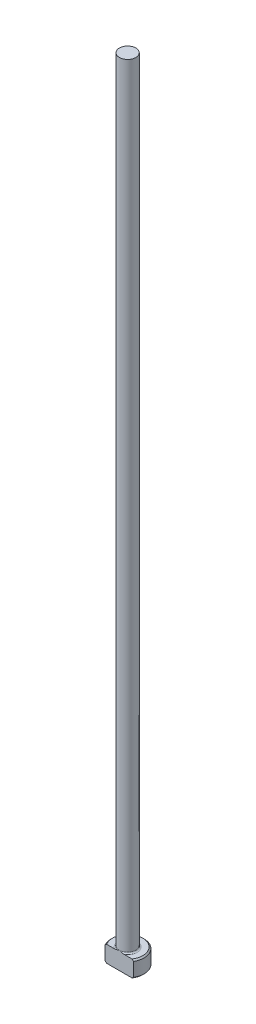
ISO-10303-21;
HEADER;
FILE_DESCRIPTION(('STEP AP214'),'2;1');
FILE_NAME('part.step','',(''),(''),'','','');
FILE_SCHEMA(('AUTOMOTIVE_DESIGN { 1 0 10303 214 1 1 1 1 }'));
ENDSEC;
DATA;
#1=APPLICATION_CONTEXT('core data for automotive mechanical design processes');
#2=APPLICATION_PROTOCOL_DEFINITION('international standard','automotive_design',2000,#1);
#3=PRODUCT_CONTEXT('',#1,'mechanical');
#4=PRODUCT('Part','Part','',(#3));
#5=PRODUCT_RELATED_PRODUCT_CATEGORY('part','',(#4));
#6=PRODUCT_DEFINITION_FORMATION('','',#4);
#7=PRODUCT_DEFINITION_CONTEXT('part definition',#1,'design');
#8=PRODUCT_DEFINITION('design','',#6,#7);
#9=PRODUCT_DEFINITION_SHAPE('','',#8);
#10=(LENGTH_UNIT() NAMED_UNIT(*) SI_UNIT(.MILLI.,.METRE.));
#11=(NAMED_UNIT(*) PLANE_ANGLE_UNIT() SI_UNIT($,.RADIAN.));
#12=(NAMED_UNIT(*) SI_UNIT($,.STERADIAN.) SOLID_ANGLE_UNIT());
#13=UNCERTAINTY_MEASURE_WITH_UNIT(LENGTH_MEASURE(1.E-05),#10,'distance_accuracy_value','');
#14=(GEOMETRIC_REPRESENTATION_CONTEXT(3) GLOBAL_UNCERTAINTY_ASSIGNED_CONTEXT((#13)) GLOBAL_UNIT_ASSIGNED_CONTEXT((#10,
#11,#12)) REPRESENTATION_CONTEXT('',''));
#15=CARTESIAN_POINT('',(0.,0.,0.));
#16=DIRECTION('',(0.,0.,1.));
#17=DIRECTION('',(1.,0.,0.));
#18=AXIS2_PLACEMENT_3D('',#15,#16,#17);
#19=CARTESIAN_POINT('',(0.,0.,0.));
#20=DIRECTION('',(0.,-1.,0.));
#21=DIRECTION('',(0.,0.,-1.));
#22=AXIS2_PLACEMENT_3D('',#19,#20,#21);
#23=PLANE('',#22);
#24=CARTESIAN_POINT('',(0.,0.,0.));
#25=DIRECTION('',(0.,-1.,0.));
#26=DIRECTION('',(0.,0.,-1.));
#27=AXIS2_PLACEMENT_3D('',#24,#25,#26);
#28=CIRCLE('',#27,2.92099999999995);
#29=CARTESIAN_POINT('',(-2.45195529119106,0.,1.58749999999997));
#30=VERTEX_POINT('',#29);
#31=CARTESIAN_POINT('',(2.45195529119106,0.,1.58749999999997));
#32=VERTEX_POINT('',#31);
#33=EDGE_CURVE('E98',#30,#32,#28,.T.);
#34=ORIENTED_EDGE('',*,*,#33,.T.);
#35=DIRECTION('',(-1.,0.,0.));
#36=VECTOR('',#35,1.);
#37=CARTESIAN_POINT('',(-2.74963065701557,0.,1.58749999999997));
#38=LINE('',#37,#36);
#39=EDGE_CURVE('E83',#32,#30,#38,.T.);
#40=ORIENTED_EDGE('',*,*,#39,.T.);
#41=EDGE_LOOP('',(#34,#40));
#42=FACE_BOUND('',#41,.T.);
#43=ADVANCED_FACE('F32',(#42),#23,.T.);
#44=CARTESIAN_POINT('',(0.,259.958771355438,0.));
#45=DIRECTION('',(0.,1.,0.));
#46=DIRECTION('',(0.,0.,1.));
#47=AXIS2_PLACEMENT_3D('',#44,#45,#46);
#48=CYLINDRICAL_SURFACE('',#47,3.17499999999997);
#49=CARTESIAN_POINT('',(0.,2.92099999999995,0.));
#50=DIRECTION('',(0.,1.,0.));
#51=DIRECTION('',(0.,0.,1.));
#52=AXIS2_PLACEMENT_3D('',#49,#50,#51);
#53=CIRCLE('',#52,3.17499999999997);
#54=CARTESIAN_POINT('',(-2.74963065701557,2.92099999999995,1.58749999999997));
#55=VERTEX_POINT('',#54);
#56=CARTESIAN_POINT('',(2.74963065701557,2.92099999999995,1.58749999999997));
#57=VERTEX_POINT('',#56);
#58=EDGE_CURVE('E104',#55,#57,#53,.F.);
#59=ORIENTED_EDGE('',*,*,#58,.T.);
#60=DIRECTION('',(0.,-1.,0.));
#61=VECTOR('',#60,1.);
#62=CARTESIAN_POINT('',(2.74963065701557,152.4,1.58749999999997));
#63=LINE('',#62,#61);
#64=CARTESIAN_POINT('',(2.74963065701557,0.254000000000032,1.58749999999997));
#65=VERTEX_POINT('',#64);
#66=EDGE_CURVE('E183',#57,#65,#63,.T.);
#67=ORIENTED_EDGE('',*,*,#66,.T.);
#68=CARTESIAN_POINT('',(0.,0.254000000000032,0.));
#69=DIRECTION('',(0.,-1.,0.));
#70=DIRECTION('',(0.,0.,-1.));
#71=AXIS2_PLACEMENT_3D('',#68,#69,#70);
#72=CIRCLE('',#71,3.17499999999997);
#73=CARTESIAN_POINT('',(-2.74963065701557,0.254000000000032,1.58749999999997));
#74=VERTEX_POINT('',#73);
#75=EDGE_CURVE('E100',#65,#74,#72,.F.);
#76=ORIENTED_EDGE('',*,*,#75,.T.);
#77=DIRECTION('',(0.,-1.,0.));
#78=VECTOR('',#77,1.);
#79=CARTESIAN_POINT('',(-2.74963065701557,152.4,1.58749999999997));
#80=LINE('',#79,#78);
#81=EDGE_CURVE('E93',#55,#74,#80,.T.);
#82=ORIENTED_EDGE('',*,*,#81,.F.);
#83=EDGE_LOOP('',(#59,#67,#76,#82));
#84=FACE_BOUND('',#83,.T.);
#85=ADVANCED_FACE('F158',(#84),#48,.T.);
#86=CARTESIAN_POINT('',(-3.17499999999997,3.175,0.));
#87=DIRECTION('',(0.,1.,0.));
#88=DIRECTION('',(0.,0.,1.));
#89=AXIS2_PLACEMENT_3D('',#86,#87,#88);
#90=PLANE('',#89);
#91=CARTESIAN_POINT('',(0.,3.175,0.));
#92=DIRECTION('',(0.,1.,0.));
#93=DIRECTION('',(0.,0.,1.));
#94=AXIS2_PLACEMENT_3D('',#91,#92,#93);
#95=CIRCLE('',#94,2.92099999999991);
#96=CARTESIAN_POINT('',(2.451955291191,3.175,1.58749999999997));
#97=VERTEX_POINT('',#96);
#98=CARTESIAN_POINT('',(-2.451955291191,3.175,1.58749999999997));
#99=VERTEX_POINT('',#98);
#100=EDGE_CURVE('E178',#97,#99,#95,.T.);
#101=ORIENTED_EDGE('',*,*,#100,.T.);
#102=DIRECTION('',(1.,0.,0.));
#103=VECTOR('',#102,1.);
#104=CARTESIAN_POINT('',(-3.17499999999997,3.175,1.58749999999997));
#105=LINE('',#104,#103);
#106=CARTESIAN_POINT('',(-0.933255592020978,3.17500000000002,1.58749999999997));
#107=VERTEX_POINT('',#106);
#108=EDGE_CURVE('E57',#99,#107,#105,.T.);
#109=ORIENTED_EDGE('',*,*,#108,.T.);
#110=CARTESIAN_POINT('',(0.,3.175,0.));
#111=DIRECTION('',(0.,1.,0.));
#112=DIRECTION('',(0.,0.,1.));
#113=AXIS2_PLACEMENT_3D('',#110,#111,#112);
#114=CIRCLE('',#113,1.84149999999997);
#115=CARTESIAN_POINT('',(0.933255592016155,3.17500000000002,1.58749999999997));
#116=VERTEX_POINT('',#115);
#117=EDGE_CURVE('E107',#107,#116,#114,.F.);
#118=ORIENTED_EDGE('',*,*,#117,.T.);
#119=EDGE_CURVE('E136',#116,#97,#105,.T.);
#120=ORIENTED_EDGE('',*,*,#119,.T.);
#121=EDGE_LOOP('',(#101,#109,#118,#120));
#122=FACE_BOUND('',#121,.T.);
#123=ADVANCED_FACE('F147',(#122),#90,.T.);
#124=CARTESIAN_POINT('',(0.,3.17499999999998,0.));
#125=DIRECTION('',(0.,-1.,0.));
#126=DIRECTION('',(0.,0.,-1.));
#127=AXIS2_PLACEMENT_3D('',#124,#125,#126);
#128=CONICAL_SURFACE('',#127,2.92099999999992,0.785398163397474);
#129=ORIENTED_EDGE('',*,*,#58,.F.);
#130=CARTESIAN_POINT('',(-6.0529050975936,-0.161620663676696,1.58749999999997));
#131=CARTESIAN_POINT('',(-5.91567682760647,-0.0288893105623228,1.58749999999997));
#132=CARTESIAN_POINT('',(-5.77831035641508,0.103699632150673,1.58749999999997));
#133=CARTESIAN_POINT('',(-5.50321874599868,0.368508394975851,1.58749999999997));
#134=CARTESIAN_POINT('',(-5.36549360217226,0.500728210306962,1.58749999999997));
#135=CARTESIAN_POINT('',(-5.08953516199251,0.764778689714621,1.58749999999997));
#136=CARTESIAN_POINT('',(-4.95130164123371,0.896609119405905,1.58749999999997));
#137=CARTESIAN_POINT('',(-4.67428233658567,1.15968706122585,1.58749999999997));
#138=CARTESIAN_POINT('',(-4.53549655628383,1.29093457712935,1.58749999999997));
#139=CARTESIAN_POINT('',(-4.25997724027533,1.55007705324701,1.58749999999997));
#140=CARTESIAN_POINT('',(-4.12325766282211,1.67798684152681,1.58749999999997));
#141=CARTESIAN_POINT('',(-3.8489289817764,1.9328486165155,1.58749999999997));
#142=CARTESIAN_POINT('',(-3.71131988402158,2.0598006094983,1.58749999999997));
#143=CARTESIAN_POINT('',(-3.43493978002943,2.31237508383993,1.58749999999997));
#144=CARTESIAN_POINT('',(-3.29616903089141,2.43799784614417,1.58749999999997));
#145=CARTESIAN_POINT('',(-3.01699558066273,2.68741369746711,1.58749999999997));
#146=CARTESIAN_POINT('',(-2.87659294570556,2.81120686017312,1.58749999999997));
#147=CARTESIAN_POINT('',(-2.64816703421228,3.00875865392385,1.58749999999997));
#148=CARTESIAN_POINT('',(-2.56087478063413,3.0833615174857,1.58749999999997));
#149=CARTESIAN_POINT('',(-2.38515423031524,3.23123871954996,1.58749999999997));
#150=CARTESIAN_POINT('',(-2.29672582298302,3.30451292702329,1.58749999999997));
#151=CARTESIAN_POINT('',(-2.117474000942,3.45004422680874,1.58749999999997));
#152=CARTESIAN_POINT('',(-2.02663514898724,3.52228237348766,1.58749999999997));
#153=CARTESIAN_POINT('',(-1.84302524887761,3.66423097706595,1.58749999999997));
#154=CARTESIAN_POINT('',(-1.75025467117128,3.73394203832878,1.58749999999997));
#155=CARTESIAN_POINT('',(-1.56067475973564,3.87080633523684,1.58749999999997));
#156=CARTESIAN_POINT('',(-1.46382547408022,3.93790459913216,1.58749999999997));
#157=CARTESIAN_POINT('',(-1.26632594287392,4.06669147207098,1.58749999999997));
#158=CARTESIAN_POINT('',(-1.16567073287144,4.12837264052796,1.58749999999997));
#159=CARTESIAN_POINT('',(-1.01165766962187,4.21402252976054,1.58749999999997));
#160=CARTESIAN_POINT('',(-0.960142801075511,4.24127929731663,1.58749999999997));
#161=CARTESIAN_POINT('',(-0.855780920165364,4.29309798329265,1.58749999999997));
#162=CARTESIAN_POINT('',(-0.802933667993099,4.31765941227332,1.58749999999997));
#163=CARTESIAN_POINT('',(-0.642461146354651,4.38614656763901,1.58749999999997));
#164=CARTESIAN_POINT('',(-0.532518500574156,4.42510149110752,1.58749999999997));
#165=CARTESIAN_POINT('',(-0.367680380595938,4.46726244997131,1.58749999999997));
#166=CARTESIAN_POINT('',(-0.314802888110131,4.47844427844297,1.58749999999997));
#167=CARTESIAN_POINT('',(-0.20820970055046,4.49576654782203,1.58749999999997));
#168=CARTESIAN_POINT('',(-0.15449408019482,4.50190743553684,1.58749999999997));
#169=CARTESIAN_POINT('',(-0.0468792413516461,4.50871296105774,1.58749999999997));
#170=CARTESIAN_POINT('',(0.00701889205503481,4.50939451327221,1.58749999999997));
#171=CARTESIAN_POINT('',(0.11460608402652,4.50527679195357,1.58749999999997));
#172=CARTESIAN_POINT('',(0.168295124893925,4.50047706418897,1.58749999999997));
#173=CARTESIAN_POINT('',(0.274485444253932,4.48579689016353,1.58749999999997));
#174=CARTESIAN_POINT('',(0.326992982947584,4.47596081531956,1.58749999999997));
#175=CARTESIAN_POINT('',(0.430974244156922,4.45181809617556,1.58749999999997));
#176=CARTESIAN_POINT('',(0.482447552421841,4.43750969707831,1.58749999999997));
#177=CARTESIAN_POINT('',(0.58446088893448,4.4050248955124,1.58749999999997));
#178=CARTESIAN_POINT('',(0.6349940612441,4.38682724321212,1.58749999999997));
#179=CARTESIAN_POINT('',(0.734789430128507,4.34729308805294,1.58749999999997));
#180=CARTESIAN_POINT('',(0.784051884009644,4.32595722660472,1.58749999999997));
#181=CARTESIAN_POINT('',(0.930549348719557,4.25791922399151,1.58749999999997));
#182=CARTESIAN_POINT('',(1.02598802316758,4.20736047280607,1.58749999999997));
#183=CARTESIAN_POINT('',(1.21304313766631,4.09955451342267,1.58749999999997));
#184=CARTESIAN_POINT('',(1.3046547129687,4.04229912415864,1.58749999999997));
#185=CARTESIAN_POINT('',(1.48526211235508,3.92308746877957,1.58749999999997));
#186=CARTESIAN_POINT('',(1.57424615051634,3.86111349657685,1.58749999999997));
#187=CARTESIAN_POINT('',(1.74990003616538,3.73408621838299,1.58749999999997));
#188=CARTESIAN_POINT('',(1.83657099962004,3.66903444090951,1.58749999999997));
#189=CARTESIAN_POINT('',(2.0093176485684,3.5358337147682,1.58749999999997));
#190=CARTESIAN_POINT('',(2.09537048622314,3.46765527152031,1.58749999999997));
#191=CARTESIAN_POINT('',(2.26611736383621,3.32960643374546,1.58749999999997));
#192=CARTESIAN_POINT('',(2.35081125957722,3.25973586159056,1.58749999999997));
#193=CARTESIAN_POINT('',(2.6029012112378,3.04858139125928,1.58749999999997));
#194=CARTESIAN_POINT('',(2.76872537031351,2.90542388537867,1.58749999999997));
#195=CARTESIAN_POINT('',(3.0697091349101,2.64069522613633,1.58749999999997));
#196=CARTESIAN_POINT('',(3.20528660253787,2.51959458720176,1.58749999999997));
#197=CARTESIAN_POINT('',(3.47510321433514,2.27590400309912,1.58749999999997));
#198=CARTESIAN_POINT('',(3.60934232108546,2.15331401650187,1.58749999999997));
#199=CARTESIAN_POINT('',(3.87695374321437,1.90694239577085,1.58749999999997));
#200=CARTESIAN_POINT('',(4.01032512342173,1.78315974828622,1.58749999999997));
#201=CARTESIAN_POINT('',(4.27630880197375,1.53478104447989,1.58749999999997));
#202=CARTESIAN_POINT('',(4.40892109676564,1.41018498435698,1.58749999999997));
#203=CARTESIAN_POINT('',(4.79499418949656,1.04574684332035,1.58749999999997));
#204=CARTESIAN_POINT('',(5.04767313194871,0.805076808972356,1.58749999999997));
#205=CARTESIAN_POINT('',(5.42550911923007,0.443121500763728,1.58749999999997));
#206=CARTESIAN_POINT('',(5.55118772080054,0.322378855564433,1.58749999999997));
#207=CARTESIAN_POINT('',(5.80225207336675,0.0805914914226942,1.58749999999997));
#208=CARTESIAN_POINT('',(5.92763782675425,-0.0404532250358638,1.58749999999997));
#209=CARTESIAN_POINT('',(6.0529050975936,-0.161620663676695,1.58749999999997));
#210=B_SPLINE_CURVE_WITH_KNOTS('',3,(#130,#131,#132,#133,#134,#135,#136,#137,#138,#139,#140,
#141,#142,#143,#144,#145,#146,#147,#148,#149,#150,#151,#152,#153,#154,#155,#156,#157,#158,#159,
#160,#161,#162,#163,#164,#165,#166,#167,#168,#169,#170,#171,#172,#173,#174,#175,#176,#177,#178,
#179,#180,#181,#182,#183,#184,#185,#186,#187,#188,#189,#190,#191,#192,#193,#194,#195,#196,#197,
#198,#199,#200,#201,#202,#203,#204,#205,#206,#207,#208,#209),.UNSPECIFIED.,.F.,.F.,(4,2,2,2,2,2,
2,2,2,2,2,2,2,2,2,2,2,2,2,2,2,2,2,2,2,2,2,2,2,2,2,2,2,2,2,2,2,2,2,4),(0.,0.572750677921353,
1.14550874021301,1.7185605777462,2.29160869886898,2.8532800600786,3.41494773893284,
3.97649423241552,4.53801804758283,4.88249307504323,5.22700189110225,5.57515326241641,
5.92322081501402,6.27657800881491,6.63041319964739,6.80518126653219,6.97998101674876,
7.32824262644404,7.49018491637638,7.65211285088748,7.81353889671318,7.97497832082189,
8.13501929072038,8.29512313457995,8.45612518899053,8.6170943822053,8.94062993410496,
9.26456495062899,9.58978187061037,9.9148389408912,10.2441741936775,10.573544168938,
11.2306812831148,11.7760337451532,12.3214014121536,12.8672825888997,13.4131663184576,
14.4600164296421,14.982859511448,15.5056983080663),.UNSPECIFIED.);
#211=EDGE_CURVE('E135',#55,#99,#210,.T.);
#212=ORIENTED_EDGE('',*,*,#211,.T.);
#213=ORIENTED_EDGE('',*,*,#100,.F.);
#214=EDGE_CURVE('E127',#97,#57,#210,.T.);
#215=ORIENTED_EDGE('',*,*,#214,.T.);
#216=EDGE_LOOP('',(#129,#212,#213,#215));
#217=FACE_BOUND('',#216,.T.);
#218=ADVANCED_FACE('F143',(#217),#128,.T.);
#219=CARTESIAN_POINT('',(0.,0.254000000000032,0.));
#220=DIRECTION('',(0.,1.,0.));
#221=DIRECTION('',(0.,0.,1.));
#222=AXIS2_PLACEMENT_3D('',#219,#220,#221);
#223=CONICAL_SURFACE('',#222,3.17499999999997,0.785398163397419);
#224=ORIENTED_EDGE('',*,*,#75,.F.);
#225=CARTESIAN_POINT('',(6.0529050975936,3.33662066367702,1.58749999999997));
#226=CARTESIAN_POINT('',(5.91567682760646,3.20388931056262,1.58749999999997));
#227=CARTESIAN_POINT('',(5.77831035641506,3.0713003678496,1.58749999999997));
#228=CARTESIAN_POINT('',(5.50321874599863,2.80649160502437,1.58749999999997));
#229=CARTESIAN_POINT('',(5.36549360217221,2.67427178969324,1.58749999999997));
#230=CARTESIAN_POINT('',(5.08953516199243,2.41022131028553,1.58749999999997));
#231=CARTESIAN_POINT('',(4.95130164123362,2.27839088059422,1.58749999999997));
#232=CARTESIAN_POINT('',(4.67428233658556,2.01531293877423,1.58749999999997));
#233=CARTESIAN_POINT('',(4.5354965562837,1.88406542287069,1.58749999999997));
#234=CARTESIAN_POINT('',(4.25997724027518,1.62492294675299,1.58749999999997));
#235=CARTESIAN_POINT('',(4.12325766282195,1.49701315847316,1.58749999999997));
#236=CARTESIAN_POINT('',(3.84892898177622,1.24215138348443,1.58749999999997));
#237=CARTESIAN_POINT('',(3.71131988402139,1.11519939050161,1.58749999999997));
#238=CARTESIAN_POINT('',(3.43493978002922,0.862624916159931,1.58749999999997));
#239=CARTESIAN_POINT('',(3.29616903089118,0.737002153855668,1.58749999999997));
#240=CARTESIAN_POINT('',(3.01699558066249,0.487586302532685,1.58749999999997));
#241=CARTESIAN_POINT('',(2.8765929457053,0.363793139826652,1.58749999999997));
#242=CARTESIAN_POINT('',(2.64816703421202,0.166241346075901,1.58749999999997));
#243=CARTESIAN_POINT('',(2.56087478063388,0.091638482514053,1.58749999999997));
#244=CARTESIAN_POINT('',(2.385154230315,-0.0562387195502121,1.58749999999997));
#245=CARTESIAN_POINT('',(2.29672582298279,-0.129512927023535,1.58749999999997));
#246=CARTESIAN_POINT('',(2.11747400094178,-0.275044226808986,1.58749999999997));
#247=CARTESIAN_POINT('',(2.02663514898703,-0.347282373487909,1.58749999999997));
#248=CARTESIAN_POINT('',(1.84302524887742,-0.489230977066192,1.58749999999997));
#249=CARTESIAN_POINT('',(1.75025467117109,-0.558942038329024,1.58749999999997));
#250=CARTESIAN_POINT('',(1.56067475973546,-0.695806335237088,1.58749999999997));
#251=CARTESIAN_POINT('',(1.46382547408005,-0.762904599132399,1.58749999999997));
#252=CARTESIAN_POINT('',(1.26632594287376,-0.891691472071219,1.58749999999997));
#253=CARTESIAN_POINT('',(1.16567073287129,-0.953372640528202,1.58749999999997));
#254=CARTESIAN_POINT('',(1.01165766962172,-1.03902252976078,1.58749999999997));
#255=CARTESIAN_POINT('',(0.96014280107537,-1.06627929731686,1.58749999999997));
#256=CARTESIAN_POINT('',(0.855780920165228,-1.11809798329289,1.58749999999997));
#257=CARTESIAN_POINT('',(0.802933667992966,-1.14265941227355,1.58749999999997));
#258=CARTESIAN_POINT('',(0.642461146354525,-1.21114656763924,1.58749999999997));
#259=CARTESIAN_POINT('',(0.532518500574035,-1.25010149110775,1.58749999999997));
#260=CARTESIAN_POINT('',(0.367680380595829,-1.29226244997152,1.58749999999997));
#261=CARTESIAN_POINT('',(0.314802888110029,-1.30344427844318,1.58749999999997));
#262=CARTESIAN_POINT('',(0.208209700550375,-1.32076654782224,1.58749999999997));
#263=CARTESIAN_POINT('',(0.154494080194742,-1.32690743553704,1.58749999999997));
#264=CARTESIAN_POINT('',(0.0468792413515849,-1.33371296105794,1.58749999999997));
#265=CARTESIAN_POINT('',(-0.0070188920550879,-1.3343945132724,1.58749999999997));
#266=CARTESIAN_POINT('',(-0.114606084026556,-1.33027679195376,1.58749999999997));
#267=CARTESIAN_POINT('',(-0.168295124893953,-1.32547706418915,1.58749999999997));
#268=CARTESIAN_POINT('',(-0.274485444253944,-1.31079689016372,1.58749999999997));
#269=CARTESIAN_POINT('',(-0.326992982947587,-1.30096081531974,1.58749999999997));
#270=CARTESIAN_POINT('',(-0.430974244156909,-1.27681809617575,1.58749999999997));
#271=CARTESIAN_POINT('',(-0.48244755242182,-1.2625096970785,1.58749999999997));
#272=CARTESIAN_POINT('',(-0.584460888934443,-1.2300248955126,1.58749999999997));
#273=CARTESIAN_POINT('',(-0.634994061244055,-1.21182724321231,1.58749999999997));
#274=CARTESIAN_POINT('',(-0.734789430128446,-1.17229308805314,1.58749999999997));
#275=CARTESIAN_POINT('',(-0.784051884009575,-1.15095722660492,1.58749999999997));
#276=CARTESIAN_POINT('',(-0.930549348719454,-1.08291922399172,1.58749999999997));
#277=CARTESIAN_POINT('',(-1.02598802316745,-1.03236047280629,1.58749999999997));
#278=CARTESIAN_POINT('',(-1.21304313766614,-0.924554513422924,1.58749999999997));
#279=CARTESIAN_POINT('',(-1.3046547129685,-0.867299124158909,1.58749999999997));
#280=CARTESIAN_POINT('',(-1.48526211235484,-0.748087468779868,1.58749999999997));
#281=CARTESIAN_POINT('',(-1.57424615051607,-0.686113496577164,1.58749999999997));
#282=CARTESIAN_POINT('',(-1.74990003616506,-0.559086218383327,1.58749999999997));
#283=CARTESIAN_POINT('',(-1.8365709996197,-0.494034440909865,1.58749999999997));
#284=CARTESIAN_POINT('',(-2.00931764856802,-0.360833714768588,1.58749999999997));
#285=CARTESIAN_POINT('',(-2.09537048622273,-0.29265527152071,1.58749999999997));
#286=CARTESIAN_POINT('',(-2.26611736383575,-0.154606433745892,1.58749999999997));
#287=CARTESIAN_POINT('',(-2.35081125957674,-0.0847358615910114,1.58749999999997));
#288=CARTESIAN_POINT('',(-2.60290121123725,0.126418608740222,1.58749999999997));
#289=CARTESIAN_POINT('',(-2.76872537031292,0.269576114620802,1.58749999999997));
#290=CARTESIAN_POINT('',(-3.06970913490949,0.534304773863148,1.58749999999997));
#291=CARTESIAN_POINT('',(-3.2052866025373,0.655405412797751,1.58749999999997));
#292=CARTESIAN_POINT('',(-3.47510321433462,0.899095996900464,1.58749999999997));
#293=CARTESIAN_POINT('',(-3.60934232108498,1.02168598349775,1.58749999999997));
#294=CARTESIAN_POINT('',(-3.87695374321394,1.26805760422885,1.58749999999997));
#295=CARTESIAN_POINT('',(-4.01032512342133,1.39184025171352,1.58749999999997));
#296=CARTESIAN_POINT('',(-4.27630880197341,1.64021895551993,1.58749999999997));
#297=CARTESIAN_POINT('',(-4.40892109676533,1.76481501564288,1.58749999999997));
#298=CARTESIAN_POINT('',(-4.79499418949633,2.12925315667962,1.58749999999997));
#299=CARTESIAN_POINT('',(-5.04767313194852,2.36992319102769,1.58749999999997));
#300=CARTESIAN_POINT('',(-5.42550911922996,2.73187849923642,1.58749999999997));
#301=CARTESIAN_POINT('',(-5.55118772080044,2.85262114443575,1.58749999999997));
#302=CARTESIAN_POINT('',(-5.80225207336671,3.09440850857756,1.58749999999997));
#303=CARTESIAN_POINT('',(-5.92763782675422,3.21545322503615,1.58749999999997));
#304=CARTESIAN_POINT('',(-6.0529050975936,3.33662066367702,1.58749999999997));
#305=B_SPLINE_CURVE_WITH_KNOTS('',3,(#225,#226,#227,#228,#229,#230,#231,#232,#233,#234,#235,
#236,#237,#238,#239,#240,#241,#242,#243,#244,#245,#246,#247,#248,#249,#250,#251,#252,#253,#254,
#255,#256,#257,#258,#259,#260,#261,#262,#263,#264,#265,#266,#267,#268,#269,#270,#271,#272,#273,
#274,#275,#276,#277,#278,#279,#280,#281,#282,#283,#284,#285,#286,#287,#288,#289,#290,#291,#292,
#293,#294,#295,#296,#297,#298,#299,#300,#301,#302,#303,#304),.UNSPECIFIED.,.F.,.F.,(4,2,2,2,2,2,
2,2,2,2,2,2,2,2,2,2,2,2,2,2,2,2,2,2,2,2,2,2,2,2,2,2,2,2,2,2,2,2,2,4),(0.,0.57275067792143,
1.14550874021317,1.71856057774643,2.29160869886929,2.85328006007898,3.41494773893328,
3.97649423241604,4.53801804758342,4.8824930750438,5.22700189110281,5.57515326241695,
5.92322081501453,6.27657800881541,6.63041319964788,6.80518126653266,6.97998101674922,
7.32824262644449,7.49018491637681,7.65211285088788,7.81353889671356,7.97497832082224,
8.13501929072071,8.29512313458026,8.45612518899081,8.61709438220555,8.94062993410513,
9.26456495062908,9.58978187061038,9.91483894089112,10.2441741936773,10.5735441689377,
11.2306812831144,11.776033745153,12.3214014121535,12.8672825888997,13.4131663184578,
14.4600164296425,14.9828595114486,15.505698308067),.UNSPECIFIED.);
#306=EDGE_CURVE('E86',#65,#32,#305,.T.);
#307=ORIENTED_EDGE('',*,*,#306,.T.);
#308=ORIENTED_EDGE('',*,*,#33,.F.);
#309=EDGE_CURVE('E89',#30,#74,#305,.T.);
#310=ORIENTED_EDGE('',*,*,#309,.T.);
#311=EDGE_LOOP('',(#224,#307,#308,#310));
#312=FACE_BOUND('',#311,.T.);
#313=ADVANCED_FACE('F97',(#312),#223,.T.);
#314=CARTESIAN_POINT('',(0.,3.42900000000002,0.));
#315=DIRECTION('',(0.,1.,0.));
#316=DIRECTION('',(0.,0.,1.));
#317=AXIS2_PLACEMENT_3D('',#314,#315,#316);
#318=TOROIDAL_SURFACE('',#317,1.84149999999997,0.254);
#319=CARTESIAN_POINT('',(0.,3.42900000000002,1.58749999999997));
#320=CARTESIAN_POINT('',(1.92205414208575E-10,3.42900057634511,1.58749999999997));
#321=CARTESIAN_POINT('',(1.22611617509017E-07,3.42900115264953,1.58749999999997));
#322=CARTESIAN_POINT('',(5.09676372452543E-07,3.42900226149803,1.58749999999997));
#323=CARTESIAN_POINT('',(7.78176337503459E-07,3.42900279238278,1.58749999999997));
#324=CARTESIAN_POINT('',(1.42307274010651E-06,3.42900385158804,1.58749999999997));
#325=CARTESIAN_POINT('',(1.80713868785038E-06,3.42900437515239,1.58749999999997));
#326=CARTESIAN_POINT('',(2.6349484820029E-06,3.42900536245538,1.58749999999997));
#327=CARTESIAN_POINT('',(3.07814758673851E-06,3.42900582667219,1.58749999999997));
#328=CARTESIAN_POINT('',(4.66897360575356E-06,3.42900738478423,1.58749999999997));
#329=CARTESIAN_POINT('',(5.89404912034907E-06,3.42900840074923,1.58749999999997));
#330=CARTESIAN_POINT('',(8.42427515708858E-06,3.42901020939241,1.58749999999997));
#331=CARTESIAN_POINT('',(9.72480579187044E-06,3.42901100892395,1.58749999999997));
#332=CARTESIAN_POINT('',(1.48060602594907E-05,3.42901401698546,1.58749999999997));
#333=CARTESIAN_POINT('',(1.86838282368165E-05,3.42901606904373,1.58749999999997));
#334=CARTESIAN_POINT('',(2.63261118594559E-05,3.42901942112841,1.58749999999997));
#335=CARTESIAN_POINT('',(3.00687418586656E-05,3.42902077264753,1.58749999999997));
#336=CARTESIAN_POINT('',(4.60276300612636E-05,3.42902652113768,1.58749999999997));
#337=CARTESIAN_POINT('',(5.82470200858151E-05,3.42903088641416,1.58749999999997));
#338=CARTESIAN_POINT('',(8.11070100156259E-05,3.42903788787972,1.58749999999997));
#339=CARTESIAN_POINT('',(9.16953117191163E-05,3.42904068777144,1.58749999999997));
#340=CARTESIAN_POINT('',(0.000168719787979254,3.42906287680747,1.58749999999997));
#341=CARTESIAN_POINT('',(0.000232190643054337,3.42909118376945,1.58749999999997));
#342=CARTESIAN_POINT('',(0.00047902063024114,3.4291972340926,1.58749999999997));
#343=CARTESIAN_POINT('',(0.000664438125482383,3.42926834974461,1.58749999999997));
#344=CARTESIAN_POINT('',(0.00138448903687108,3.42954862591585,1.58749999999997));
#345=CARTESIAN_POINT('',(0.00191701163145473,3.42976473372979,1.58749999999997));
#346=CARTESIAN_POINT('',(0.00409774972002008,3.4306455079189,1.58749999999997));
#347=CARTESIAN_POINT('',(0.00574830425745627,3.43130231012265,1.58749999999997));
#348=CARTESIAN_POINT('',(0.0289985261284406,3.44055947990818,1.58749999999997));
#349=CARTESIAN_POINT('',(0.0505816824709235,3.44921674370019,1.58749999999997));
#350=CARTESIAN_POINT('',(0.092994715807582,3.46610702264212,1.58749999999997));
#351=CARTESIAN_POINT('',(0.11382315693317,3.47434394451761,1.58749999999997));
#352=CARTESIAN_POINT('',(0.157956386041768,3.49164606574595,1.58749999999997));
#353=CARTESIAN_POINT('',(0.181267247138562,3.50069608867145,1.58749999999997));
#354=CARTESIAN_POINT('',(0.228222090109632,3.51863224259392,1.58749999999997));
#355=CARTESIAN_POINT('',(0.251867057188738,3.52751579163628,1.58749999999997));
#356=CARTESIAN_POINT('',(0.310512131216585,3.54905503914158,1.58749999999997));
#357=CARTESIAN_POINT('',(0.345588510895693,3.56150550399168,1.58749999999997));
#358=CARTESIAN_POINT('',(0.415278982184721,3.58503024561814,1.58749999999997));
#359=CARTESIAN_POINT('',(0.449884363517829,3.59613012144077,1.58749999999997));
#360=CARTESIAN_POINT('',(0.524471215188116,3.61841679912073,1.58749999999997));
#361=CARTESIAN_POINT('',(0.564517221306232,3.62939137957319,1.58749999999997));
#362=CARTESIAN_POINT('',(0.64552942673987,3.64897465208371,1.58749999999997));
#363=CARTESIAN_POINT('',(0.686500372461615,3.6575641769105,1.58749999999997));
#364=CARTESIAN_POINT('',(0.771546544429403,3.67188287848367,1.58749999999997));
#365=CARTESIAN_POINT('',(0.815658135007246,3.67740449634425,1.58749999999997));
#366=CARTESIAN_POINT('',(0.904117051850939,3.68344603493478,1.58749999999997));
#367=CARTESIAN_POINT('',(0.948462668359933,3.68398638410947,1.58749999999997));
#368=CARTESIAN_POINT('',(1.02531896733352,3.67901051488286,1.58749999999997));
#369=CARTESIAN_POINT('',(1.05792141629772,3.67502604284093,1.58749999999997));
#370=CARTESIAN_POINT('',(1.12184393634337,3.66230832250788,1.58749999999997));
#371=CARTESIAN_POINT('',(1.15317534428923,3.65363950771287,1.58749999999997));
#372=CARTESIAN_POINT('',(1.19946468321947,3.63563847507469,1.58749999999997));
#373=CARTESIAN_POINT('',(1.21526783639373,3.62848492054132,1.58749999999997));
#374=CARTESIAN_POINT('',(1.24583726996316,3.61212937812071,1.58749999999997));
#375=CARTESIAN_POINT('',(1.26060215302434,3.60292469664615,1.58749999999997));
#376=CARTESIAN_POINT('',(1.2857581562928,3.5842151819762,1.58749999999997));
#377=CARTESIAN_POINT('',(1.2964438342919,3.57510998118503,1.58749999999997));
#378=CARTESIAN_POINT('',(1.31623154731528,3.55531539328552,1.58749999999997));
#379=CARTESIAN_POINT('',(1.32533681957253,3.5446293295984,1.58749999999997));
#380=CARTESIAN_POINT('',(1.33941140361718,3.52450022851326,1.58749999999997));
#381=CARTESIAN_POINT('',(1.34484814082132,3.51538553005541,1.58749999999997));
#382=CARTESIAN_POINT('',(1.35416329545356,3.49638544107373,1.58749999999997));
#383=CARTESIAN_POINT('',(1.35804267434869,3.48650053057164,1.58749999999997));
#384=CARTESIAN_POINT('',(1.36398436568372,3.46611321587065,1.58749999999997));
#385=CARTESIAN_POINT('',(1.3660335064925,3.45560690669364,1.58749999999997));
#386=CARTESIAN_POINT('',(1.3680840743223,3.43439627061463,1.58749999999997));
#387=CARTESIAN_POINT('',(1.36808648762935,3.42369204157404,1.58749999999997));
#388=CARTESIAN_POINT('',(1.36616208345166,3.40366716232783,1.58749999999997));
#389=CARTESIAN_POINT('',(1.36444960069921,3.39432493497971,1.58749999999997));
#390=CARTESIAN_POINT('',(1.35953338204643,3.37604480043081,1.58749999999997));
#391=CARTESIAN_POINT('',(1.3563294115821,3.36710695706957,1.58749999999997));
#392=CARTESIAN_POINT('',(1.34848006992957,3.34949697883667,1.58749999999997));
#393=CARTESIAN_POINT('',(1.3437857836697,3.34084688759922,1.58749999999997));
#394=CARTESIAN_POINT('',(1.3332444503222,3.32428742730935,1.58749999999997));
#395=CARTESIAN_POINT('',(1.32739692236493,3.31637836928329,1.58749999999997));
#396=CARTESIAN_POINT('',(1.31107304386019,3.2969287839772,1.58749999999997));
#397=CARTESIAN_POINT('',(1.29989286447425,3.28597778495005,1.58749999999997));
#398=CARTESIAN_POINT('',(1.275935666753,3.26597490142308,1.58749999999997));
#399=CARTESIAN_POINT('',(1.2631537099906,3.25692913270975,1.58749999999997));
#400=CARTESIAN_POINT('',(1.22930733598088,3.23613976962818,1.58749999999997));
#401=CARTESIAN_POINT('',(1.2075109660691,3.22559415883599,1.58749999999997));
#402=CARTESIAN_POINT('',(1.16266144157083,3.20795356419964,1.58749999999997));
#403=CARTESIAN_POINT('',(1.13960937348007,3.20085564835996,1.58749999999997));
#404=CARTESIAN_POINT('',(1.07603916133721,3.18534571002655,1.58749999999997));
#405=CARTESIAN_POINT('',(1.03486686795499,3.17965078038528,1.58749999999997));
#406=CARTESIAN_POINT('',(0.951558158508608,3.1741711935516,1.58749999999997));
#407=CARTESIAN_POINT('',(0.909417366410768,3.17449023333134,1.58749999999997));
#408=CARTESIAN_POINT('',(0.811383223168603,3.18054602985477,1.58749999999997));
#409=CARTESIAN_POINT('',(0.755610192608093,3.18806126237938,1.58749999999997));
#410=CARTESIAN_POINT('',(0.644937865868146,3.20866626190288,1.58749999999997));
#411=CARTESIAN_POINT('',(0.590043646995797,3.22178102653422,1.58749999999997));
#412=CARTESIAN_POINT('',(0.485757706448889,3.25059077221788,1.58749999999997));
#413=CARTESIAN_POINT('',(0.436281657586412,3.26598903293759,1.58749999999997));
#414=CARTESIAN_POINT('',(0.338551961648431,3.29877502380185,1.58749999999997));
#415=CARTESIAN_POINT('',(0.290291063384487,3.3161415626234,1.58749999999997));
#416=CARTESIAN_POINT('',(0.22555793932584,3.34039762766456,1.58749999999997));
#417=CARTESIAN_POINT('',(0.208874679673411,3.3467358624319,1.58749999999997));
#418=CARTESIAN_POINT('',(0.175123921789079,3.35969957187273,1.58749999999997));
#419=CARTESIAN_POINT('',(0.158057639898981,3.36632823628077,1.58749999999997));
#420=CARTESIAN_POINT('',(0.117638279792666,3.38214476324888,1.58749999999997));
#421=CARTESIAN_POINT('',(0.0943002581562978,3.39137029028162,1.58749999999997));
#422=CARTESIAN_POINT('',(0.0497824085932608,3.40910304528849,1.58749999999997));
#423=CARTESIAN_POINT('',(0.0285986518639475,3.41759960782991,1.58749999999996));
#424=CARTESIAN_POINT('',(0.00575168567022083,3.42669635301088,1.58749999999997));
#425=CARTESIAN_POINT('',(0.00410451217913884,3.42735181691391,1.58749999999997));
#426=CARTESIAN_POINT('',(0.00192459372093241,3.4282322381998,1.58749999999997));
#427=CARTESIAN_POINT('',(0.00138952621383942,3.42844937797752,1.58749999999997));
#428=CARTESIAN_POINT('',(0.000666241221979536,3.42873091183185,1.58749999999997));
#429=CARTESIAN_POINT('',(0.000480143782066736,3.42880228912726,1.58749999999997));
#430=CARTESIAN_POINT('',(0.000232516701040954,3.42890868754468,1.58749999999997));
#431=CARTESIAN_POINT('',(0.000168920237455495,3.42893705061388,1.58749999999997));
#432=CARTESIAN_POINT('',(9.17527164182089E-05,3.42895927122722,1.58749999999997));
#433=CARTESIAN_POINT('',(8.11550295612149E-05,3.4289620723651,1.58749999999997));
#434=CARTESIAN_POINT('',(5.82743950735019E-05,3.42896908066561,1.58749999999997));
#435=CARTESIAN_POINT('',(4.60440003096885E-05,3.42897345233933,1.58749999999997));
#436=CARTESIAN_POINT('',(3.00727683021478E-05,3.42897920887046,1.58749999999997));
#437=CARTESIAN_POINT('',(2.63286808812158E-05,3.42898056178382,1.58749999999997));
#438=CARTESIAN_POINT('',(1.8683653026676E-05,3.42898391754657,1.58749999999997));
#439=CARTESIAN_POINT('',(1.48046517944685E-05,3.42898597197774,1.58749999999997));
#440=CARTESIAN_POINT('',(9.72223946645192E-06,3.42898898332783,1.58749999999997));
#441=CARTESIAN_POINT('',(8.42159652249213E-06,3.42898978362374,1.58749999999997));
#442=CARTESIAN_POINT('',(5.8912973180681E-06,3.4289915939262,1.58749999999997));
#443=CARTESIAN_POINT('',(4.66626869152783E-06,3.42899261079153,1.58749999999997));
#444=CARTESIAN_POINT('',(3.07568805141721E-06,3.42899417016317,1.58749999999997));
#445=CARTESIAN_POINT('',(2.63259567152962E-06,3.42899463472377,1.58749999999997));
#446=CARTESIAN_POINT('',(1.80506086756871E-06,3.42899562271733,1.58749999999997));
#447=CARTESIAN_POINT('',(1.42116388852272E-06,3.42899614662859,1.58749999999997));
#448=CARTESIAN_POINT('',(7.76675648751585E-07,3.42899720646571,1.58749999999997));
#449=CARTESIAN_POINT('',(5.08406491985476E-07,3.42899773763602,1.58749999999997));
#450=CARTESIAN_POINT('',(1.21901888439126E-07,3.4289988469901,1.58749999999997));
#451=CARTESIAN_POINT('',(-1.92251944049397E-10,3.4289994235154,1.58749999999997));
#452=CARTESIAN_POINT('',(0.,3.42900000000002,1.58749999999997));
#453=B_SPLINE_CURVE_WITH_KNOTS('',3,(#319,#320,#321,#322,#323,#324,#325,#326,#327,#328,#329,
#330,#331,#332,#333,#334,#335,#336,#337,#338,#339,#340,#341,#342,#343,#344,#345,#346,#347,#348,
#349,#350,#351,#352,#353,#354,#355,#356,#357,#358,#359,#360,#361,#362,#363,#364,#365,#366,#367,
#368,#369,#370,#371,#372,#373,#374,#375,#376,#377,#378,#379,#380,#381,#382,#383,#384,#385,#386,
#387,#388,#389,#390,#391,#392,#393,#394,#395,#396,#397,#398,#399,#400,#401,#402,#403,#404,#405,
#406,#407,#408,#409,#410,#411,#412,#413,#414,#415,#416,#417,#418,#419,#420,#421,#422,#423,#424,
#425,#426,#427,#428,#429,#430,#431,#432,#433,#434,#435,#436,#437,#438,#439,#440,#441,#442,#443,
#444,#445,#446,#447,#448,#449,#450,#451,#452),.UNSPECIFIED.,.T.,.F.,(4,2,2,2,2,2,2,2,2,2,2,2,2,
2,2,2,2,2,2,2,2,2,2,2,2,2,2,2,2,2,2,2,2,2,2,2,2,2,2,2,2,2,2,2,2,2,2,2,2,2,2,2,2,2,2,2,2,2,2,2,2,
2,2,2,2,2,4),(0.,1.72815455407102E-06,3.50429249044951E-06,5.44430995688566E-06,
7.36755238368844E-06,1.21190895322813E-05,1.66953773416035E-05,2.98160398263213E-05,
4.17409561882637E-05,8.06604751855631E-05,0.000113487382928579,0.000321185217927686,
0.000917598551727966,0.00264089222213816,0.00797105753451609,0.0777276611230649,
0.144923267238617,0.219939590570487,0.295714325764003,0.407362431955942,0.516367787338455,
0.640878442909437,0.766362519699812,0.899536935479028,1.03216495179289,1.13045740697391,
1.22743103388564,1.27935899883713,1.33135556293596,1.37333248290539,1.41522237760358,
1.44693946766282,1.47863694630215,1.51056074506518,1.54246916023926,1.57083210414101,
1.59919951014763,1.62861579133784,1.65804436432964,1.70472658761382,1.75155645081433,
1.82378709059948,1.89595619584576,2.01995471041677,2.14609321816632,2.31447224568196,
2.48361094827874,2.63898919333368,2.79283011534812,2.84637031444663,2.90129461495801,
2.97658236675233,3.04504771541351,3.05036697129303,3.05209849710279,3.05269709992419,
3.05290520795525,3.05293806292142,3.05297701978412,3.05298895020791,3.05300207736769,
3.05300665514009,3.0530114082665,3.05301333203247,3.0530152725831,3.05301704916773,
3.05301877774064),.UNSPECIFIED.);
#454=CARTESIAN_POINT('',(0.,3.42900000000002,1.58749999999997));
#455=VERTEX_POINT('',#454);
#456=EDGE_CURVE('E11',#116,#455,#453,.T.);
#457=ORIENTED_EDGE('',*,*,#456,.F.);
#458=ORIENTED_EDGE('',*,*,#117,.F.);
#459=CARTESIAN_POINT('',(0.,3.42900000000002,1.58749999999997));
#460=CARTESIAN_POINT('',(-1.92205429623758E-10,3.42899942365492,1.58749999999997));
#461=CARTESIAN_POINT('',(-1.22611617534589E-07,3.4289988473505,1.58749999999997));
#462=CARTESIAN_POINT('',(-5.0967637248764E-07,3.428997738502,1.58749999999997));
#463=CARTESIAN_POINT('',(-7.78176337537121E-07,3.42899720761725,1.58749999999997));
#464=CARTESIAN_POINT('',(-1.42307274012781E-06,3.42899614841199,1.58749999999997));
#465=CARTESIAN_POINT('',(-1.80713868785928E-06,3.42899562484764,1.58749999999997));
#466=CARTESIAN_POINT('',(-2.63494848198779E-06,3.42899463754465,1.58749999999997));
#467=CARTESIAN_POINT('',(-3.07814758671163E-06,3.42899417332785,1.58749999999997));
#468=CARTESIAN_POINT('',(-4.66897360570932E-06,3.4289926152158,1.58749999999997));
#469=CARTESIAN_POINT('',(-5.89404912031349E-06,3.4289915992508,1.58749999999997));
#470=CARTESIAN_POINT('',(-8.4242751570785E-06,3.42898979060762,1.58749999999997));
#471=CARTESIAN_POINT('',(-9.72480579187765E-06,3.42898899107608,1.58749999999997));
#472=CARTESIAN_POINT('',(-1.48060602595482E-05,3.42898598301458,1.58749999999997));
#473=CARTESIAN_POINT('',(-1.86838282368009E-05,3.4289839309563,1.58749999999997));
#474=CARTESIAN_POINT('',(-2.63261118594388E-05,3.42898057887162,1.58749999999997));
#475=CARTESIAN_POINT('',(-3.00687418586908E-05,3.4289792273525,1.58749999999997));
#476=CARTESIAN_POINT('',(-4.60276300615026E-05,3.42897347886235,1.58749999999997));
#477=CARTESIAN_POINT('',(-5.82470200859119E-05,3.42896911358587,1.58749999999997));
#478=CARTESIAN_POINT('',(-8.11070100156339E-05,3.42896211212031,1.58749999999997));
#479=CARTESIAN_POINT('',(-9.16953117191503E-05,3.42895931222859,1.58749999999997));
#480=CARTESIAN_POINT('',(-0.000168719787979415,3.42893712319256,1.58749999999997));
#481=CARTESIAN_POINT('',(-0.000232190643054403,3.42890881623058,1.58749999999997));
#482=CARTESIAN_POINT('',(-0.000479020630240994,3.42880276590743,1.58749999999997));
#483=CARTESIAN_POINT('',(-0.000664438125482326,3.42873165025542,1.58749999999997));
#484=CARTESIAN_POINT('',(-0.00138448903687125,3.42845137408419,1.58749999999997));
#485=CARTESIAN_POINT('',(-0.00191701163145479,3.42823526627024,1.58749999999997));
#486=CARTESIAN_POINT('',(-0.00409774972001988,3.42735449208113,1.58749999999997));
#487=CARTESIAN_POINT('',(-0.00574830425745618,3.42669768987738,1.58749999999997));
#488=CARTESIAN_POINT('',(-0.0289985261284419,3.41744052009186,1.58749999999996));
#489=CARTESIAN_POINT('',(-0.0505816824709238,3.40878325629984,1.58749999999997));
#490=CARTESIAN_POINT('',(-0.0929947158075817,3.39189297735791,1.58749999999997));
#491=CARTESIAN_POINT('',(-0.11382315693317,3.38365605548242,1.58749999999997));
#492=CARTESIAN_POINT('',(-0.157956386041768,3.36635393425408,1.58749999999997));
#493=CARTESIAN_POINT('',(-0.181267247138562,3.35730391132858,1.58749999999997));
#494=CARTESIAN_POINT('',(-0.228222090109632,3.33936775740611,1.58749999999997));
#495=CARTESIAN_POINT('',(-0.251867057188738,3.33048420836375,1.58749999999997));
#496=CARTESIAN_POINT('',(-0.310512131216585,3.30894496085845,1.58749999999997));
#497=CARTESIAN_POINT('',(-0.345588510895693,3.29649449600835,1.58749999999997));
#498=CARTESIAN_POINT('',(-0.415278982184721,3.2729697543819,1.58749999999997));
#499=CARTESIAN_POINT('',(-0.449884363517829,3.26186987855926,1.58749999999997));
#500=CARTESIAN_POINT('',(-0.524471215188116,3.2395832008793,1.58749999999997));
#501=CARTESIAN_POINT('',(-0.564517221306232,3.22860862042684,1.58749999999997));
#502=CARTESIAN_POINT('',(-0.64552942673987,3.20902534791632,1.58749999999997));
#503=CARTESIAN_POINT('',(-0.686500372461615,3.20043582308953,1.58749999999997));
#504=CARTESIAN_POINT('',(-0.771546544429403,3.18611712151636,1.58749999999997));
#505=CARTESIAN_POINT('',(-0.815658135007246,3.18059550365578,1.58749999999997));
#506=CARTESIAN_POINT('',(-0.904117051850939,3.17455396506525,1.58749999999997));
#507=CARTESIAN_POINT('',(-0.948462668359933,3.17401361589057,1.58749999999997));
#508=CARTESIAN_POINT('',(-1.02531896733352,3.17898948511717,1.58749999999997));
#509=CARTESIAN_POINT('',(-1.05792141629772,3.1829739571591,1.58749999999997));
#510=CARTESIAN_POINT('',(-1.12184393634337,3.19569167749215,1.58749999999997));
#511=CARTESIAN_POINT('',(-1.15317534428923,3.20436049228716,1.58749999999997));
#512=CARTESIAN_POINT('',(-1.19946468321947,3.22236152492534,1.58749999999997));
#513=CARTESIAN_POINT('',(-1.21526783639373,3.22951507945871,1.58749999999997));
#514=CARTESIAN_POINT('',(-1.24583726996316,3.24587062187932,1.58749999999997));
#515=CARTESIAN_POINT('',(-1.26060215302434,3.25507530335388,1.58749999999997));
#516=CARTESIAN_POINT('',(-1.2857581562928,3.27378481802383,1.58749999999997));
#517=CARTESIAN_POINT('',(-1.2964438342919,3.282890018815,1.58749999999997));
#518=CARTESIAN_POINT('',(-1.31623154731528,3.30268460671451,1.58749999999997));
#519=CARTESIAN_POINT('',(-1.32533681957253,3.31337067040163,1.58749999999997));
#520=CARTESIAN_POINT('',(-1.33941140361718,3.33349977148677,1.58749999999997));
#521=CARTESIAN_POINT('',(-1.34484814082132,3.34261446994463,1.58749999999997));
#522=CARTESIAN_POINT('',(-1.35416329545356,3.3616145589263,1.58749999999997));
#523=CARTESIAN_POINT('',(-1.35804267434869,3.37149946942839,1.58749999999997));
#524=CARTESIAN_POINT('',(-1.36398436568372,3.39188678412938,1.58749999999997));
#525=CARTESIAN_POINT('',(-1.3660335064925,3.40239309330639,1.58749999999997));
#526=CARTESIAN_POINT('',(-1.3680840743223,3.4236037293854,1.58749999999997));
#527=CARTESIAN_POINT('',(-1.36808648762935,3.43430795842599,1.58749999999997));
#528=CARTESIAN_POINT('',(-1.36616208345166,3.4543328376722,1.58749999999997));
#529=CARTESIAN_POINT('',(-1.36444960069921,3.46367506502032,1.58749999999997));
#530=CARTESIAN_POINT('',(-1.35953338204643,3.48195519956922,1.58749999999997));
#531=CARTESIAN_POINT('',(-1.3563294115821,3.49089304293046,1.58749999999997));
#532=CARTESIAN_POINT('',(-1.34848006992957,3.50850302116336,1.58749999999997));
#533=CARTESIAN_POINT('',(-1.3437857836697,3.51715311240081,1.58749999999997));
#534=CARTESIAN_POINT('',(-1.3332444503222,3.53371257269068,1.58749999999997));
#535=CARTESIAN_POINT('',(-1.32739692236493,3.54162163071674,1.58749999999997));
#536=CARTESIAN_POINT('',(-1.31107304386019,3.56107121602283,1.58749999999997));
#537=CARTESIAN_POINT('',(-1.29989286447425,3.57202221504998,1.58749999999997));
#538=CARTESIAN_POINT('',(-1.275935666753,3.59202509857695,1.58749999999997));
#539=CARTESIAN_POINT('',(-1.2631537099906,3.60107086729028,1.58749999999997));
#540=CARTESIAN_POINT('',(-1.22930733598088,3.62186023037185,1.58749999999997));
#541=CARTESIAN_POINT('',(-1.2075109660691,3.63240584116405,1.58749999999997));
#542=CARTESIAN_POINT('',(-1.16266144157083,3.6500464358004,1.58749999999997));
#543=CARTESIAN_POINT('',(-1.13960937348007,3.65714435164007,1.58749999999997));
#544=CARTESIAN_POINT('',(-1.07603916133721,3.67265428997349,1.58749999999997));
#545=CARTESIAN_POINT('',(-1.03486686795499,3.67834921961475,1.58749999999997));
#546=CARTESIAN_POINT('',(-0.951558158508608,3.68382880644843,1.58749999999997));
#547=CARTESIAN_POINT('',(-0.909417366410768,3.68350976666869,1.58749999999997));
#548=CARTESIAN_POINT('',(-0.811383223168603,3.67745397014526,1.58749999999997));
#549=CARTESIAN_POINT('',(-0.755610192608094,3.66993873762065,1.58749999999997));
#550=CARTESIAN_POINT('',(-0.644937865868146,3.64933373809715,1.58749999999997));
#551=CARTESIAN_POINT('',(-0.590043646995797,3.63621897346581,1.58749999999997));
#552=CARTESIAN_POINT('',(-0.485757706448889,3.60740922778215,1.58749999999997));
#553=CARTESIAN_POINT('',(-0.436281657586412,3.59201096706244,1.58749999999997));
#554=CARTESIAN_POINT('',(-0.338551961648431,3.55922497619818,1.58749999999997));
#555=CARTESIAN_POINT('',(-0.290291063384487,3.54185843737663,1.58749999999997));
#556=CARTESIAN_POINT('',(-0.22555793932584,3.51760237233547,1.58749999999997));
#557=CARTESIAN_POINT('',(-0.208874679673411,3.51126413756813,1.58749999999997));
#558=CARTESIAN_POINT('',(-0.175123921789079,3.4983004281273,1.58749999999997));
#559=CARTESIAN_POINT('',(-0.158057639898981,3.49167176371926,1.58749999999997));
#560=CARTESIAN_POINT('',(-0.117638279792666,3.47585523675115,1.58749999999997));
#561=CARTESIAN_POINT('',(-0.0943002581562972,3.46662970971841,1.58749999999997));
#562=CARTESIAN_POINT('',(-0.0497824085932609,3.44889695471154,1.58749999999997));
#563=CARTESIAN_POINT('',(-0.0285986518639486,3.44040039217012,1.58749999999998));
#564=CARTESIAN_POINT('',(-0.00575168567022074,3.43130364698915,1.58749999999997));
#565=CARTESIAN_POINT('',(-0.00410451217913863,3.43064818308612,1.58749999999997));
#566=CARTESIAN_POINT('',(-0.00192459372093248,3.42976776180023,1.58749999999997));
#567=CARTESIAN_POINT('',(-0.00138952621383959,3.42955062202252,1.58749999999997));
#568=CARTESIAN_POINT('',(-0.00066624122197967,3.42926908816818,1.58749999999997));
#569=CARTESIAN_POINT('',(-0.000480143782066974,3.42919771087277,1.58749999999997));
#570=CARTESIAN_POINT('',(-0.000232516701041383,3.42909131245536,1.58749999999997));
#571=CARTESIAN_POINT('',(-0.000168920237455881,3.42906294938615,1.58749999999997));
#572=CARTESIAN_POINT('',(-9.17527164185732E-05,3.42904072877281,1.58749999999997));
#573=CARTESIAN_POINT('',(-8.11550295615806E-05,3.42903792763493,1.58749999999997));
#574=CARTESIAN_POINT('',(-5.827439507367E-05,3.42903091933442,1.58749999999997));
#575=CARTESIAN_POINT('',(-4.60440003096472E-05,3.4290265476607,1.58749999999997));
#576=CARTESIAN_POINT('',(-3.00727683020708E-05,3.42902079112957,1.58749999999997));
#577=CARTESIAN_POINT('',(-2.6328680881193E-05,3.42901943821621,1.58749999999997));
#578=CARTESIAN_POINT('',(-1.86836530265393E-05,3.42901608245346,1.58749999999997));
#579=CARTESIAN_POINT('',(-1.48046517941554E-05,3.42901402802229,1.58749999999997));
#580=CARTESIAN_POINT('',(-9.72223946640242E-06,3.4290110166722,1.58749999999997));
#581=CARTESIAN_POINT('',(-8.42159652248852E-06,3.42901021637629,1.58749999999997));
#582=CARTESIAN_POINT('',(-5.8912973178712E-06,3.42900840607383,1.58749999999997));
#583=CARTESIAN_POINT('',(-4.66626869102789E-06,3.4290073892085,1.58749999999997));
#584=CARTESIAN_POINT('',(-3.07568805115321E-06,3.42900582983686,1.58749999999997));
#585=CARTESIAN_POINT('',(-2.63259567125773E-06,3.42900536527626,1.58749999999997));
#586=CARTESIAN_POINT('',(-1.80506086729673E-06,3.4290043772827,1.58749999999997));
#587=CARTESIAN_POINT('',(-1.42116388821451E-06,3.42900385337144,1.58749999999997));
#588=CARTESIAN_POINT('',(-7.76675648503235E-07,3.42900279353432,1.58749999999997));
#589=CARTESIAN_POINT('',(-5.08406491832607E-07,3.42900226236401,1.58749999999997));
#590=CARTESIAN_POINT('',(-1.21901888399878E-07,3.42900115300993,1.58749999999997));
#591=CARTESIAN_POINT('',(1.92251959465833E-10,3.42900057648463,1.58749999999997));
#592=CARTESIAN_POINT('',(0.,3.42900000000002,1.58749999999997));
#593=B_SPLINE_CURVE_WITH_KNOTS('',3,(#459,#460,#461,#462,#463,#464,#465,#466,#467,#468,#469,
#470,#471,#472,#473,#474,#475,#476,#477,#478,#479,#480,#481,#482,#483,#484,#485,#486,#487,#488,
#489,#490,#491,#492,#493,#494,#495,#496,#497,#498,#499,#500,#501,#502,#503,#504,#505,#506,#507,
#508,#509,#510,#511,#512,#513,#514,#515,#516,#517,#518,#519,#520,#521,#522,#523,#524,#525,#526,
#527,#528,#529,#530,#531,#532,#533,#534,#535,#536,#537,#538,#539,#540,#541,#542,#543,#544,#545,
#546,#547,#548,#549,#550,#551,#552,#553,#554,#555,#556,#557,#558,#559,#560,#561,#562,#563,#564,
#565,#566,#567,#568,#569,#570,#571,#572,#573,#574,#575,#576,#577,#578,#579,#580,#581,#582,#583,
#584,#585,#586,#587,#588,#589,#590,#591,#592),.UNSPECIFIED.,.T.,.F.,(4,2,2,2,2,2,2,2,2,2,2,2,2,
2,2,2,2,2,2,2,2,2,2,2,2,2,2,2,2,2,2,2,2,2,2,2,2,2,2,2,2,2,2,2,2,2,2,2,2,2,2,2,2,2,2,2,2,2,2,2,2,
2,2,2,2,2,4),(0.,1.72815455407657E-06,3.50429249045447E-06,5.44430995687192E-06,
7.3675523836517E-06,1.21190895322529E-05,1.66953773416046E-05,2.98160398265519E-05,
4.17409561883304E-05,8.0660475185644E-05,0.000113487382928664,0.000321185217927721,
0.000917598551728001,0.00264089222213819,0.00797105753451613,0.077727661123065,
0.144923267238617,0.219939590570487,0.295714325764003,0.407362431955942,0.516367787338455,
0.640878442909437,0.766362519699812,0.899536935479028,1.03216495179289,1.13045740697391,
1.22743103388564,1.27935899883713,1.33135556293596,1.37333248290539,1.41522237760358,
1.44693946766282,1.47863694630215,1.51056074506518,1.54246916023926,1.57083210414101,
1.59919951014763,1.62861579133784,1.65804436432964,1.70472658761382,1.75155645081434,
1.82378709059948,1.89595619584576,2.01995471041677,2.14609321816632,2.31447224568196,
2.48361094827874,2.63898919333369,2.79283011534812,2.84637031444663,2.90129461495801,
2.97658236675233,3.04504771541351,3.05036697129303,3.05209849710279,3.05269709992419,
3.05290520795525,3.05293806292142,3.05297701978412,3.05298895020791,3.05300207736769,
3.05300665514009,3.0530114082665,3.05301333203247,3.0530152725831,3.05301704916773,
3.05301877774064),.UNSPECIFIED.);
#594=EDGE_CURVE('E46',#455,#107,#593,.T.);
#595=ORIENTED_EDGE('',*,*,#594,.F.);
#596=CARTESIAN_POINT('',(0.,3.42900000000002,0.));
#597=DIRECTION('',(0.,1.,0.));
#598=DIRECTION('',(0.,0.,1.));
#599=AXIS2_PLACEMENT_3D('',#596,#597,#598);
#600=CIRCLE('',#599,1.58749999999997);
#601=EDGE_CURVE('E103',#455,#455,#600,.T.);
#602=ORIENTED_EDGE('',*,*,#601,.F.);
#603=EDGE_LOOP('',(#457,#458,#595,#602));
#604=FACE_BOUND('',#603,.T.);
#605=ADVANCED_FACE('F34',(#604),#318,.F.);
#606=CARTESIAN_POINT('',(0.,259.958771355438,0.));
#607=DIRECTION('',(0.,1.,0.));
#608=DIRECTION('',(0.,0.,1.));
#609=AXIS2_PLACEMENT_3D('',#606,#607,#608);
#610=CYLINDRICAL_SURFACE('',#609,1.58749999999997);
#611=ORIENTED_EDGE('',*,*,#601,.T.);
#612=EDGE_LOOP('',(#611));
#613=FACE_BOUND('',#612,.T.);
#614=CARTESIAN_POINT('',(0.,152.4,0.));
#615=DIRECTION('',(0.,1.,0.));
#616=DIRECTION('',(0.,0.,1.));
#617=AXIS2_PLACEMENT_3D('',#614,#615,#616);
#618=CIRCLE('',#617,1.58749999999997);
#619=CARTESIAN_POINT('',(0.,152.4,1.58749999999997));
#620=VERTEX_POINT('',#619);
#621=EDGE_CURVE('E101',#620,#620,#618,.T.);
#622=ORIENTED_EDGE('',*,*,#621,.F.);
#623=EDGE_LOOP('',(#622));
#624=FACE_BOUND('',#623,.T.);
#625=ADVANCED_FACE('F155',(#613,#624),#610,.T.);
#626=CARTESIAN_POINT('',(-1.58749999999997,152.4,0.));
#627=DIRECTION('',(0.,1.,0.));
#628=DIRECTION('',(0.,0.,1.));
#629=AXIS2_PLACEMENT_3D('',#626,#627,#628);
#630=PLANE('',#629);
#631=ORIENTED_EDGE('',*,*,#621,.T.);
#632=EDGE_LOOP('',(#631));
#633=FACE_BOUND('',#632,.T.);
#634=ADVANCED_FACE('F121',(#633),#630,.T.);
#635=CARTESIAN_POINT('',(-2.74963065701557,152.4,1.58749999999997));
#636=DIRECTION('',(0.,0.,1.));
#637=DIRECTION('',(1.,0.,0.));
#638=AXIS2_PLACEMENT_3D('',#635,#636,#637);
#639=PLANE('',#638);
#640=ORIENTED_EDGE('',*,*,#66,.F.);
#641=ORIENTED_EDGE('',*,*,#214,.F.);
#642=ORIENTED_EDGE('',*,*,#119,.F.);
#643=ORIENTED_EDGE('',*,*,#456,.T.);
#644=ORIENTED_EDGE('',*,*,#594,.T.);
#645=ORIENTED_EDGE('',*,*,#108,.F.);
#646=ORIENTED_EDGE('',*,*,#211,.F.);
#647=ORIENTED_EDGE('',*,*,#81,.T.);
#648=ORIENTED_EDGE('',*,*,#309,.F.);
#649=ORIENTED_EDGE('',*,*,#39,.F.);
#650=ORIENTED_EDGE('',*,*,#306,.F.);
#651=EDGE_LOOP('',(#640,#641,#642,#643,#644,#645,#646,#647,#648,#649,#650));
#652=FACE_BOUND('',#651,.T.);
#653=ADVANCED_FACE('F85',(#652),#639,.T.);
#654=CLOSED_SHELL('',(#43,#85,#123,#218,#313,#605,#625,#634,#653));
#655=MANIFOLD_SOLID_BREP('B2',#654);
#656=ADVANCED_BREP_SHAPE_REPRESENTATION('',(#18,#655),#14);
#657=SHAPE_DEFINITION_REPRESENTATION(#9,#656);
ENDSEC;
END-ISO-10303-21;
